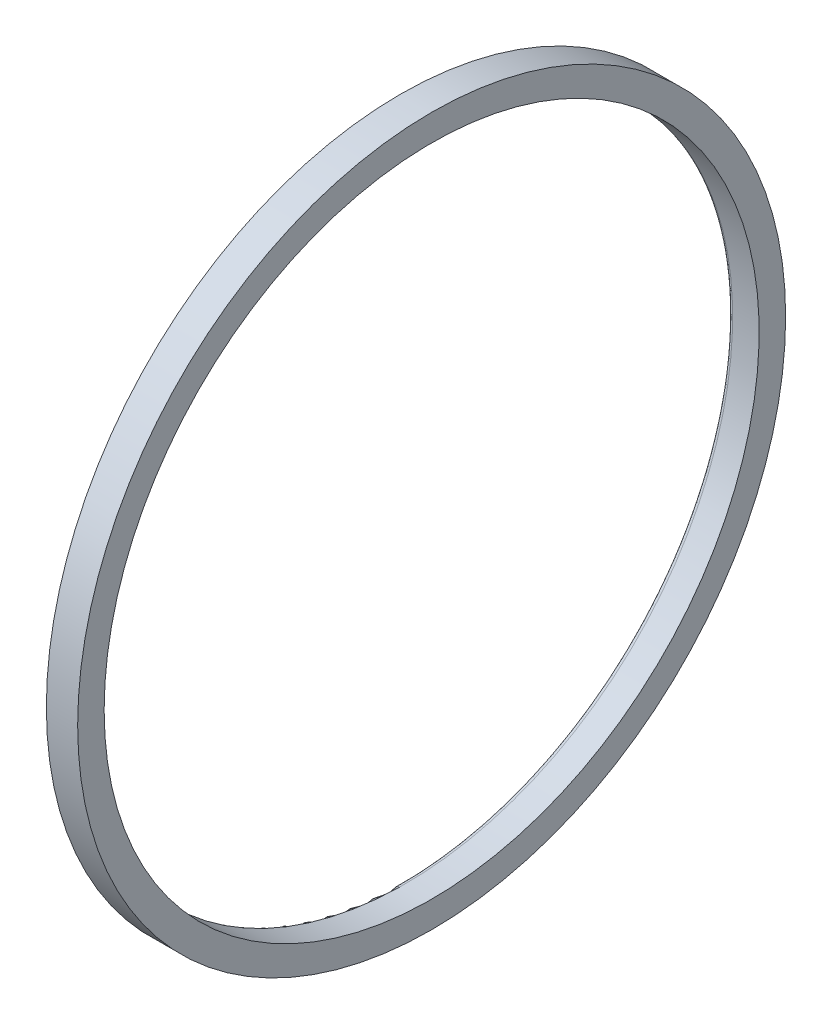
from build123d import *


with BuildPart() as part:
    # Sketch2 → Base-Revolve (revolve)
    with BuildSketch(Plane.XY, mode=Mode.PRIVATE) as base_revolve_sk:
        with BuildLine():
            Line((2.413, 17.272), (3.81, 17.272))
            Line((3.81, 17.272), (3.81, 18.669))
            Line((3.81, 18.669), (2.159, 18.669))
            Line((2.159, 18.669), (2.159, 17.526))
            ThreePointArc((2.159, 17.526), (2.233394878, 17.346394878), (2.413, 17.272))
        make_face()
    revolve(base_revolve_sk.sketch.rotate(Axis((0, 0, 0), (1, 0, 0)), 90), axis=Axis((0, 0, 0), (1, 0, 0)))


solid = part.part
